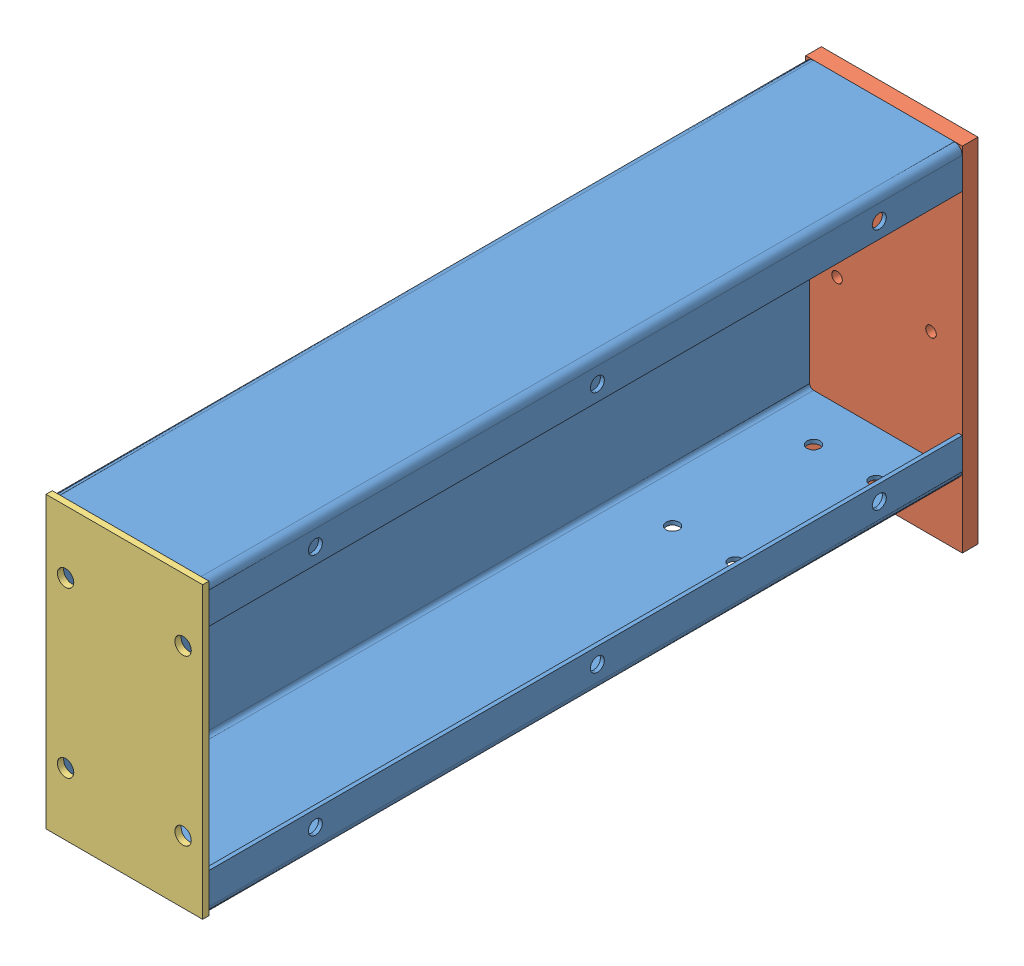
SolidWorks assembly CU030941.sldasm, configuration Défaut (file format 3400). Lengths in mm.
Overall size (100 225 495).
3 component instances, 3 part files, 6 mates.
Components (placement in the parent):
- CU030942-1: CU030942.sldprt [Défaut] at (0 185 481) x (1 0 0) z (0 0 -1) size (100 185 481)
- CU030943-1: CU030943.sldprt [Défaut] at (50 72.5 -10) x (0 1 0) z (-1 0 0) size (225 10 100)
- CU030944-1: CU030944.sldprt [Défaut] at (0 185 481) x (0 -1 0) z (0 0 1) size (185 100 4)
Mates (geometry in assembly coordinates):
- Coïncidente8: coincident anti-aligned: plane of CU030942-1 through (5 182.5 0) normal (0 0 -1); plane of CU030943-1 through (0 185 0) normal (0 0 1)
- Coïncidente9: coincident aligned: plane of CU030942-1 through (0 185 0) normal (-1 0 0); plane of CU030943-1 through (0 185 -10) normal (-1 0 0)
- Coïncidente10: coincident aligned: plane of CU030942-1 through (100 185 0) normal (0 1 0); plane of CU030943-1 through (0 185 -10) normal (0 1 0)
- Coïncidente14: coincident anti-aligned: plane of CU030942-1 through (97.5 5 481) normal (0 0 1); plane of CU030944-1 through (0 185 481) normal (0 0 -1)
- Coïncidente15: coincident aligned: plane of CU030942-1 through (100 185 0) normal (0 1 0); plane of CU030944-1 through (100 185 485) normal (0 1 0)
- Coïncidente16: coincident aligned: plane of CU030942-1 through (0 185 0) normal (-1 0 0); plane of CU030944-1 through (0 185 485) normal (-1 0 0)
